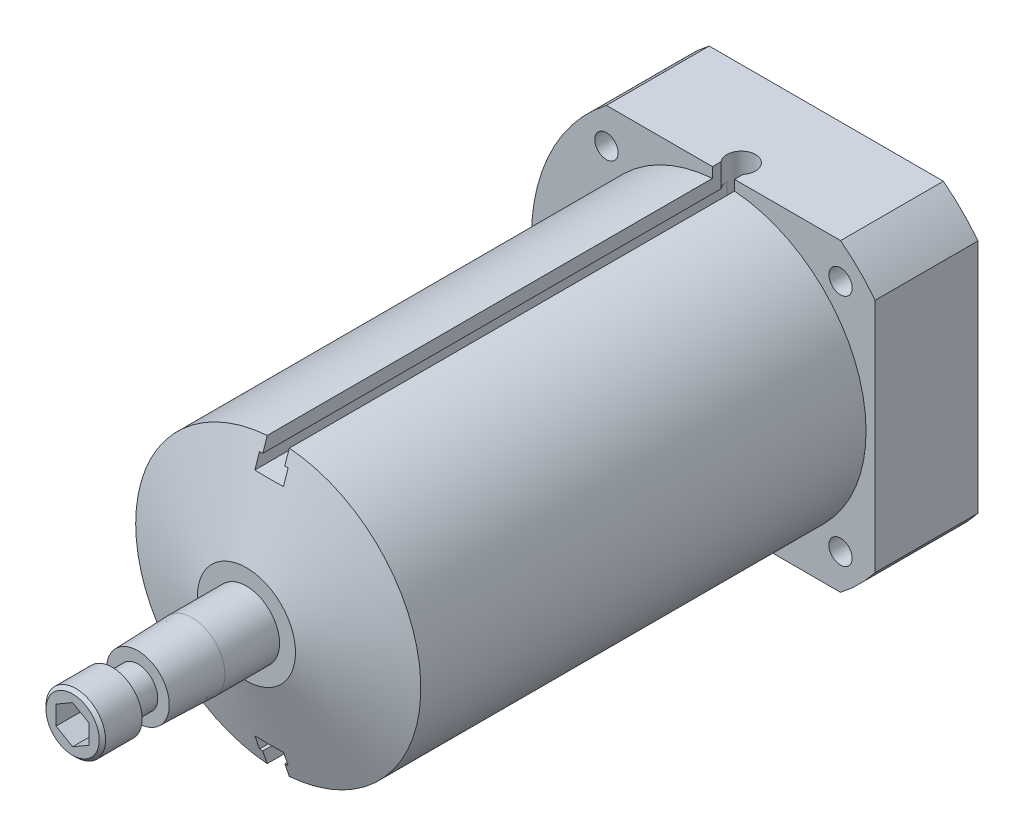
from build123d import *

# Parameters (mm, degrees)
EXTRUDE1_DEPTH     = 138.938
HOLE1_D            = 8.4328
HOLE1_DEPTH        = 19.05
HOLE1_TIP          = 2.533468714
HOLE2_D            = 5.588
CIRPATTERN1_COUNT  = 4
CUT_EXTRUDE1_DEPTH = 118.5418
CUT_EXTRUDE2_DEPTH = 98.425
CUT_EXTRUDE3_REACH = 188.164
SKETCH14_R         = 3.429
CUT_EXTRUDE4_REACH = 188.164
SKETCH15_R         = 3.429
CUT_EXTRUDE5_DEPTH = 6.35


with BuildPart() as part:
    # Sketch1 → Extrude1 (new body)
    with BuildSketch(Plane.XY):
        with BuildLine():
            Line((-28.057369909, 36.4998), (28.057369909, 36.4998))
            ThreePointArc((28.057369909, 36.4998), (32.465208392, 32.641410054), (36.3474, 28.254520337))
            Line((36.3474, 28.254520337), (36.3474, -28.254520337))
            ThreePointArc((36.3474, -28.254520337), (32.465208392, -32.641410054), (28.057369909, -36.4998))
            Line((28.057369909, -36.4998), (-28.057369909, -36.4998))
            ThreePointArc((-28.057369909, -36.4998), (-46.0375, 0), (-28.057369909, 36.4998))
        make_face()
    extrude(amount=EXTRUDE1_DEPTH)

    # Sketch2 → Cut-Revolve1 (revolve, cut)
    with BuildSketch(Plane(origin=(0, 0, 0), x_dir=(1, 0, 0), z_dir=(0, 1, 0))):
        Polygon((-46.0375, -24.638), (-34.163, -24.638), (-34.163, -131.318), (-11.7475, -138.938), (-46.0375, -138.938), align=None)
    revolve(axis=Axis((0, 0, 0), (0, 0, 1)), mode=Mode.SUBTRACT)

    # Sketch4 → Revolve1 (revolve)
    with BuildSketch(Plane(origin=(0, 0, 0), x_dir=(1, 0, 0), z_dir=(0, 1, 0))):
        Polygon((-7.93115, -138.938), (-7.93115, -152.019), (-7.52475, -164.950857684), (0, -164.950857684), (0, -138.938), align=None)
    revolve(axis=Axis((0, 0, 0), (0, 0, 1)))

    # Hole1
    with Locations(Plane.XY.offset(164.950857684)):
        with Locations((0, 0)):
            Hole(HOLE1_D / 2, depth=HOLE1_DEPTH)
            with Locations((0, 0, -(HOLE1_DEPTH + HOLE1_TIP / 2))):  # 118° drill point
                Cone(0, HOLE1_D / 2, HOLE1_TIP, mode=Mode.SUBTRACT)

    # Hole2 (through all)
    with Locations(Plane.XY.offset(24.638)):
        with Locations((28.045339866, 28.045339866)):
            hole2 = Hole(HOLE2_D / 2)

    # CirPattern1: Hole2 ×4 about axis
    cirpattern1_axis = Axis((0, 0, 0), (0, 0, 1))
    for i in range(1, CIRPATTERN1_COUNT):
        add(hole2.rotate(cirpattern1_axis, i * 360 / CIRPATTERN1_COUNT), mode=Mode.SUBTRACT)

    # Sketch11 → Cut-Revolve2 (revolve, cut)
    with BuildSketch(Plane(origin=(0, 0, 15.7988), x_dir=(-1, 0, 0), z_dir=(0, 0, -1))):
        Polygon((75.64502369, 39.870084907), (29.604588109, 18.401077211), (31.36504674, 14.625761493), (77.405482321, 36.09476919), align=None)
    cut_revolve2 = revolve(axis=Axis((0, 0, 15.7988), (-0.9063077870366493, 0.4226182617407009, 0)), mode=Mode.SUBTRACT)

    # Mirror1: Cut-Revolve2 across plane
    add(cut_revolve2.mirror(Plane.ZX), mode=Mode.SUBTRACT)

    # Sketch12 → Cut-Extrude1 (cut)
    with BuildSketch(Plane.XY.offset(138.938)):
        Polygon((-2.6416, 50.8), (-2.6416, 30.8737), (-3.429, 30.8737), (-3.429, 27.5717), (3.429, 27.5717), (3.429, 30.8737), (2.6416, 30.8737), (2.6416, 50.8), align=None)
    extrude(amount=-CUT_EXTRUDE1_DEPTH, mode=Mode.SUBTRACT)

    # Sketch13 → Cut-Extrude2 (cut)
    with BuildSketch(Plane.XY.offset(138.938)):
        Polygon((-3.429, -27.5717), (3.429, -27.5717), (3.429, -30.8737), (2.6416, -30.8737), (2.6416, -50.8), (-2.6416, -50.8), (-2.6416, -30.8737), (-3.429, -30.8737), align=None)
    extrude(amount=-CUT_EXTRUDE2_DEPTH, mode=Mode.SUBTRACT)

    # Cut-Extrude3: up to this face of the body (flat: up to its plane)
    cut_extrude3_end = Plane(part.part.faces().sort_by_distance((0, 27.5717, 76.965383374))[0])
    # Sketch14 → Cut-Extrude3 (cut, up to the picked face)
    with BuildSketch(Plane(origin=(0, 36.4998, 0), x_dir=(1, 0, 0), z_dir=(0, 1, 0)), mode=Mode.PRIVATE) as cut_extrude3_sk1:
        with Locations((0, -20.3962)):
            Circle(SKETCH14_R)
    cut_extrude3_tool1 = split(extrude(cut_extrude3_sk1.sketch, amount=-CUT_EXTRUDE3_REACH, mode=Mode.PRIVATE), bisect_by=cut_extrude3_end, keep=Keep.BOTH, mode=Mode.PRIVATE)
    add(cut_extrude3_tool1.solids().sort_by(Axis((0, 36.4998, 20.3962), (0, -1, 0)))[0], mode=Mode.SUBTRACT)

    # Cut-Extrude4: up to this face of the body (flat: up to its plane)
    cut_extrude4_end = Plane(part.part.faces().sort_by_distance((0, -27.5717, 87.023783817))[0])
    # Sketch15 → Cut-Extrude4 (cut, up to the picked face)
    with BuildSketch(Plane.XZ.offset(36.4998), mode=Mode.PRIVATE) as cut_extrude4_sk1:
        with Locations((0, 40.513)):
            Circle(SKETCH15_R)
    cut_extrude4_tool1 = split(extrude(cut_extrude4_sk1.sketch, amount=-CUT_EXTRUDE4_REACH, mode=Mode.PRIVATE), bisect_by=cut_extrude4_end, keep=Keep.BOTH, mode=Mode.PRIVATE)
    add(cut_extrude4_tool1.solids().sort_by(Axis((0, -36.4998, 40.513), (0, 1, 0)))[0], mode=Mode.SUBTRACT)

    # Sketch16 → Revolve2 (revolve)
    with BuildSketch(Plane(origin=(0, 0, 0), x_dir=(1, 0, 0), z_dir=(0, 1, 0))):
        Polygon((-4.7625, -164.950857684), (-4.7625, -171.069), (-7.1374, -171.069), (-7.1374, -179.832), (-6.3754, -180.594), (0, -180.594), (0, -164.950857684), align=None)
    revolve(axis=Axis((0, 0, 0), (0, 0, 1)))

    # Sketch17 → Cut-Extrude5 (cut)
    with BuildSketch(Plane.XY.offset(180.594)):
        Polygon((3.9624, -2.287692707), (3.9624, 2.287692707), (0, 4.575385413), (-3.9624, 2.287692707), (-3.9624, -2.287692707), (0, -4.575385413), align=None)
    extrude(amount=-CUT_EXTRUDE5_DEPTH, mode=Mode.SUBTRACT)


solid = part.part
